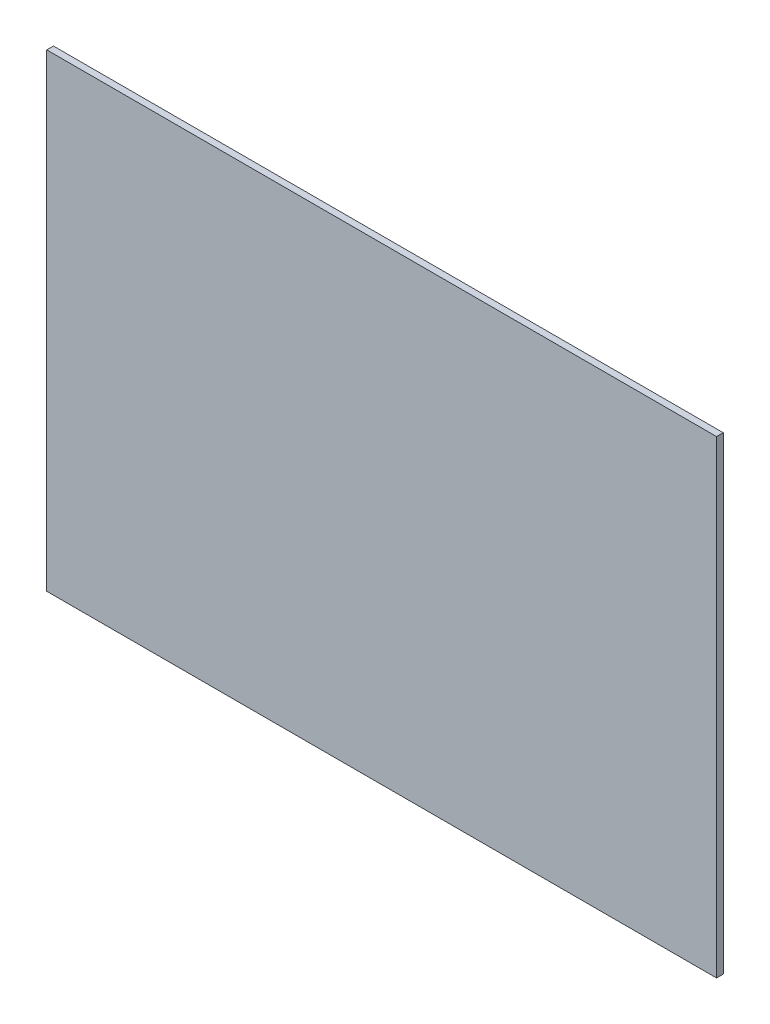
from build123d import *

# Parameters (mm, degrees)
SKETCH_1_W      = 100
SKETCH_1_H      = 70
EXTRUDE_1_DEPTH = 1


with BuildPart() as part:
    # Sketch 1 → Extrude 1 (new body)
    with BuildSketch(Plane.XY):
        with Locations((-50, 35)):
            Rectangle(SKETCH_1_W, SKETCH_1_H)
    extrude(amount=EXTRUDE_1_DEPTH)


solid = part.part
